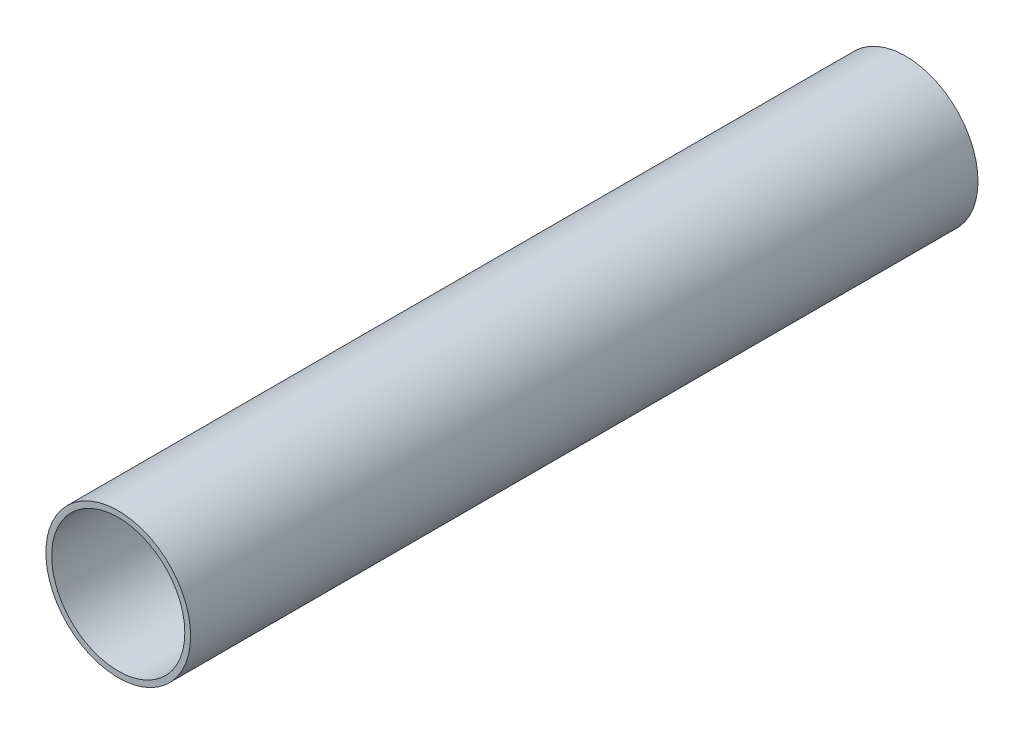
from build123d import *

# Parameters (mm, degrees)
EXTRUDE1_DEPTH      = 136
EXTRUDE1_DEPTH_BACK = 136
SKETCH1_R           = 25
SKETCH1_R_2         = 23


with BuildPart() as part:
    # Sketch1 → Extrude1 (new, two sides: drawn at the far end of the back side and taken through both)
    with BuildSketch(Plane.XY.offset(-EXTRUDE1_DEPTH_BACK)):
        Circle(SKETCH1_R)
        Circle(SKETCH1_R_2, mode=Mode.SUBTRACT)
    extrude(amount=EXTRUDE1_DEPTH + EXTRUDE1_DEPTH_BACK)


solid = part.part
